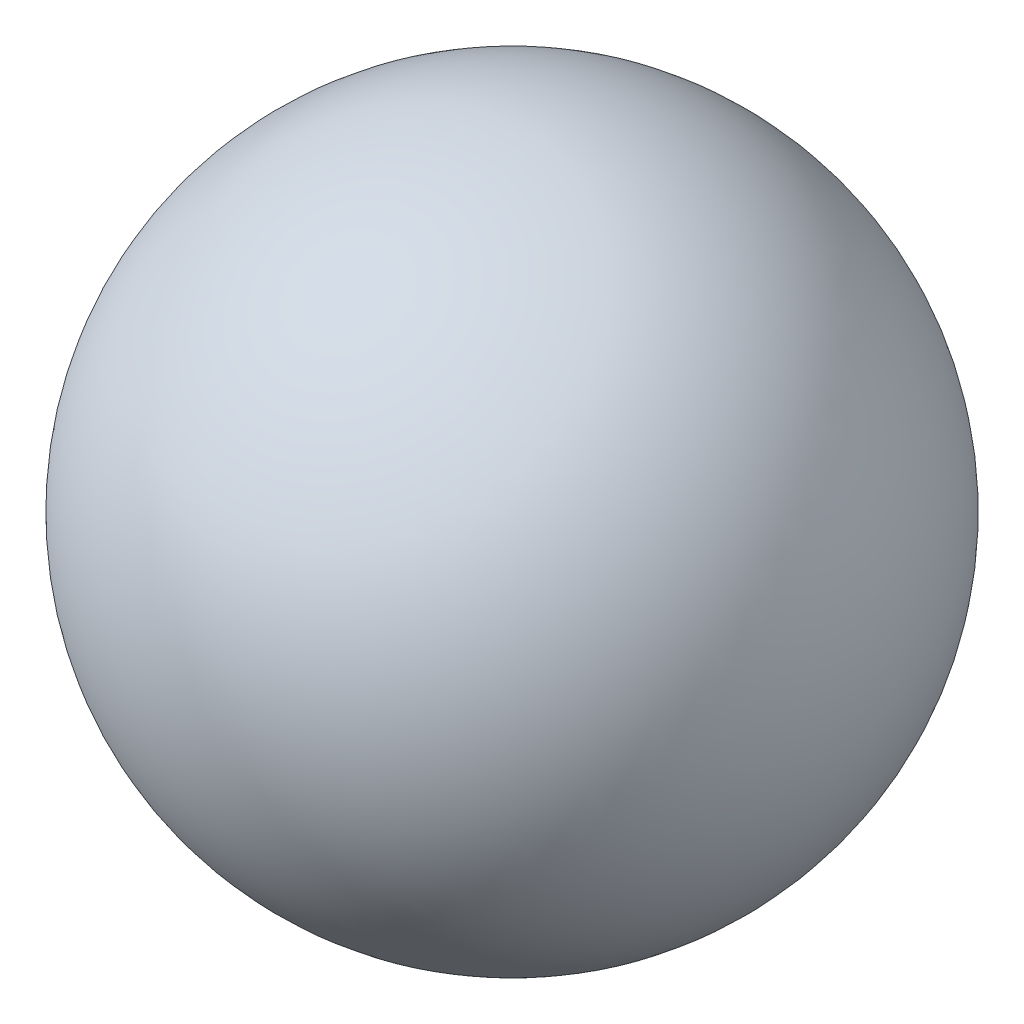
from build123d import *


with BuildPart() as part:
    # Esquisse1 → Base-R_volution (revolve)
    with BuildSketch(Plane.XY):
        with BuildLine():
            Line((0, -5.5), (0, 5.5))
            ThreePointArc((0, 5.5), (-5.5, 0), (0, -5.5))
        make_face()
    revolve(axis=Axis((0, 80, 0), (0, -1, 0)))


solid = part.part
